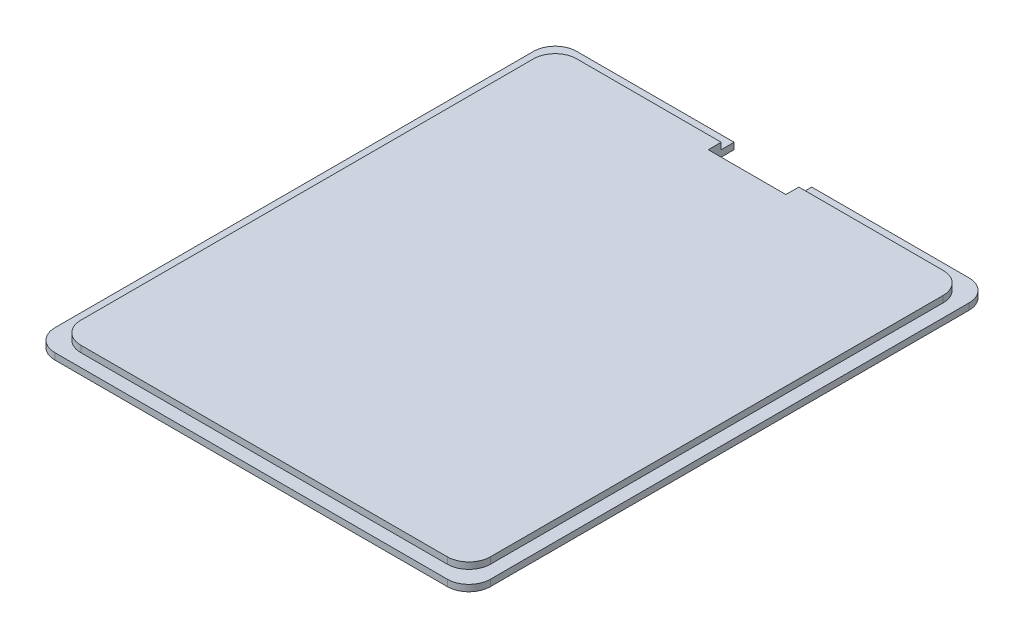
from build123d import *

# Parameters (mm, degrees)
ESQUISSE1_W             = 101
ESQUISSE1_H             = 121
BOSS_EXTRU_1_DEPTH      = 1.5
ESQUISSE4_W             = 95
ESQUISSE4_H             = 115
BOSS_EXTRU_3_DEPTH      = 1.5
CONG_2_R                = 5
ENL_V_MAT_EXTRU_2_DEPTH = 1
ENL_V_MAT_EXTRU_3_DEPTH = 1
ESQUISSE11_W            = 18
ESQUISSE11_H            = 8.115720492
ENL_V_MAT_EXTRU_4_DEPTH = 6


with BuildPart() as part:
    # Esquisse1 → Boss.-Extru.1 (new body)
    with BuildSketch(Plane(origin=(0, 0, 0), x_dir=(1, 0, 0), z_dir=(0, 1, 0))):
        Rectangle(ESQUISSE1_W, ESQUISSE1_H)
    extrude(amount=BOSS_EXTRU_1_DEPTH)

    # Esquisse4 → Boss.-Extru.3 (add)
    with BuildSketch(Plane(origin=(0, 1.5, 0), x_dir=(1, 0, 0), z_dir=(0, 1, 0))):
        Rectangle(ESQUISSE4_W, ESQUISSE4_H)
    extrude(amount=BOSS_EXTRU_3_DEPTH)

    # Cong_2
    cong_2_edges = [part.edges().sort_by_distance(p)[0] for p in [
        (47.5, 2.25, -57.5),
        (-47.5, 2.25, -57.5),
        (-47.5, 2.25, 57.5),
        (47.5, 2.25, 57.5),
        (-50.5, 0.75, -60.5),
        (50.5, 0.75, -60.5),
        (50.5, 0.75, 60.5),
        (-50.5, 0.75, 60.5),
    ]]
    fillet(cong_2_edges, radius=CONG_2_R)

    # Esquisse9 → Enl_v. mat.-Extru.2 (cut)
    # profile 1 of 4: a face of its own
    with BuildSketch(Plane.XZ):
        with BuildLine():
            Line((17.756410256, 6.536159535), (20.064102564, 6.536159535))
            add(Edge.make_bspline(
                [(20.064102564, 6.536159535), (20.05319979, 6.400313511), (20.031855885, 6.134373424), (19.958926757, 5.747839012), (19.853264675, 5.383051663), (19.711927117, 5.041039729), (19.539979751, 4.720111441), (19.330761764, 4.423514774), (19.090259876, 4.148273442), (18.816957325, 3.898725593), (18.518816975, 3.67403333), (18.196952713, 3.479581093), (17.854912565, 3.314454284), (17.492265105, 3.18095124), (17.110224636, 3.072979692), (16.706152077, 3.001609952), (16.282578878, 2.952826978), (15.993067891, 2.948581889), (15.845352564, 2.946415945)],
                knots=[0, 0, 0, 0, 1.056841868, 2.068935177, 3.046078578, 3.998599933, 4.935163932, 5.86512691, 6.808715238, 7.765748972, 8.731494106, 9.700901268, 10.678786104, 11.673881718, 12.695859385, 13.754743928, 14.85441745, 16, 16, 16, 16], degree=3))
            add(Edge.make_bspline(
                [(15.845352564, 2.946415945), (15.753840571, 2.947538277), (15.572640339, 2.949760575), (15.305273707, 2.968366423), (15.045586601, 2.997285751), (14.794673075, 3.042942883), (14.550917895, 3.095749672), (14.31507311, 3.161622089), (14.089160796, 3.242896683), (13.799799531, 3.360730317), (13.462694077, 3.540404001), (13.09617259, 3.801483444), (12.770077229, 4.103416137), (12.53854975, 4.391142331), (12.379366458, 4.635598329), (12.2747231, 4.820139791), (12.185625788, 5.00526088), (12.11366012, 5.191573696), (12.056741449, 5.378958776), (12.017018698, 5.567295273), (11.991830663, 5.756230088), (11.988726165, 5.882370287), (11.987179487, 5.945214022)],
                knots=[0, 0, 0, 0, 1.013132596, 2.00607435, 2.966243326, 3.904617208, 4.828431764, 5.727203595, 6.61345083, 7.485302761, 9.185340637, 10.828629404, 12.45552056, 14.090522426, 14.902580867, 15.683901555, 16.43787889, 17.175178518, 17.893248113, 18.603780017, 19.304395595, 20, 20, 20, 20], degree=3))
            add(Edge.make_bspline(
                [(11.987179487, 5.945214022), (11.989293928, 6.021415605), (11.99355504, 6.17498036), (12.022773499, 6.407476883), (12.070974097, 6.643848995), (12.139516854, 6.884836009), (12.228639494, 7.129176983), (12.335142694, 7.378871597), (12.461652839, 7.631886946), (12.606525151, 7.892451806), (12.782082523, 8.157822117), (12.983254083, 8.437386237), (13.222597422, 8.724238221), (13.487716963, 9.028082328), (13.789877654, 9.339515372), (14.122640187, 9.663300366), (14.485424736, 10.0013597), (14.742878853, 10.224855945), (14.875801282, 10.340246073)],
                knots=[0, 0, 0, 0, 0.67522145, 1.360735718, 2.073273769, 2.811302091, 3.578729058, 4.376688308, 5.215569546, 6.084587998, 7.016822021, 8.033531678, 9.135168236, 10.32585616, 11.606457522, 12.978966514, 14.440253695, 16, 16, 16, 16], degree=3))
            Line((14.875801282, 10.340246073), (16.25, 11.536159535))
            Line((16.25, 11.536159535), (11.858974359, 11.536159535))
            Line((11.858974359, 11.536159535), (11.858974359, 13.202826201))
            Line((11.858974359, 13.202826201), (20.448717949, 13.202826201))
            Line((20.448717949, 13.202826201), (20.448717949, 12.293371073))
            Line((20.448717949, 12.293371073), (16.608573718, 9.142329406))
            add(Edge.make_bspline(
                [(16.608573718, 9.142329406), (16.496651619, 9.050671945), (16.281062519, 8.87411745), (15.97659953, 8.611514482), (15.700713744, 8.363086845), (15.455585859, 8.126578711), (15.235145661, 7.907319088), (15.047750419, 7.699109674), (14.887039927, 7.506448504), (14.755861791, 7.324204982), (14.64549885, 7.151595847), (14.553743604, 6.984069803), (14.472814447, 6.823214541), (14.407846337, 6.66517991), (14.357846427, 6.511108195), (14.320915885, 6.361298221), (14.300645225, 6.214859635), (14.296782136, 6.118879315), (14.294871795, 6.071415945)],
                knots=[0, 0, 0, 0, 1.755009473, 3.380573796, 4.877511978, 6.258327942, 7.512837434, 8.648485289, 9.65565559, 10.555016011, 11.370810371, 12.139555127, 12.871388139, 13.554377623, 14.210211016, 14.835041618, 15.423914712, 16, 16, 16, 16], degree=3))
            add(Edge.make_bspline(
                [(14.294871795, 6.071415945), (14.296530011, 6.024584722), (14.299817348, 5.931743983), (14.322328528, 5.796062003), (14.357818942, 5.665751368), (14.4115499, 5.543899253), (14.474903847, 5.425088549), (14.558056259, 5.316437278), (14.653818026, 5.21235185), (14.800317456, 5.081819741), (15.014361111, 4.943857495), (15.304863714, 4.825077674), (15.629632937, 4.753929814), (15.856999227, 4.745620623), (15.975560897, 4.74128774)],
                knots=[0, 0, 0, 0, 0.704141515, 1.395928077, 2.063603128, 2.729538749, 3.394792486, 4.083730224, 4.780238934, 5.520004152, 7.029765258, 8.583315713, 10.218347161, 12, 12, 12, 12], degree=3))
            add(Edge.make_bspline(
                [(15.975560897, 4.74128774), (16.037054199, 4.742926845), (16.157106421, 4.746126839), (16.333625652, 4.768309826), (16.501743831, 4.806705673), (16.663215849, 4.858364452), (16.81637983, 4.92689774), (16.960827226, 5.011705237), (17.097643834, 5.110311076), (17.226090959, 5.222640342), (17.343637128, 5.347517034), (17.446911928, 5.485367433), (17.534876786, 5.634098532), (17.609579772, 5.793652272), (17.669862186, 5.963951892), (17.713089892, 6.145380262), (17.743964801, 6.33691774), (17.752190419, 6.468603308), (17.756410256, 6.536159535)],
                knots=[0, 0, 0, 0, 1.044651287, 2.039453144, 3.016437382, 3.970698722, 4.915200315, 5.860791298, 6.811607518, 7.776330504, 8.755485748, 9.719741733, 10.696396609, 11.686010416, 12.70856171, 13.759599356, 14.850648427, 16, 16, 16, 16], degree=3))
        make_face()
    # profile 2 of 4: a face of its own
    with BuildSketch(Plane.XZ):
        with BuildLine():
            Line((7.884615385, 6.536159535), (10.192307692, 6.536159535))
            add(Edge.make_bspline(
                [(10.192307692, 6.536159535), (10.181404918, 6.400313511), (10.160061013, 6.134373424), (10.087131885, 5.747839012), (9.981469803, 5.383051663), (9.840132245, 5.041039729), (9.66818488, 4.720111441), (9.458966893, 4.423514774), (9.218465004, 4.148273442), (8.945162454, 3.898725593), (8.647022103, 3.67403333), (8.325157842, 3.479581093), (7.983117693, 3.314454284), (7.620470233, 3.18095124), (7.238429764, 3.072979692), (6.834357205, 3.001609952), (6.410784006, 2.952826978), (6.121273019, 2.948581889), (5.973557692, 2.946415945)],
                knots=[0, 0, 0, 0, 1.056841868, 2.068935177, 3.046078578, 3.998599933, 4.935163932, 5.86512691, 6.808715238, 7.765748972, 8.731494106, 9.700901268, 10.678786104, 11.673881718, 12.695859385, 13.754743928, 14.85441745, 16, 16, 16, 16], degree=3))
            add(Edge.make_bspline(
                [(5.973557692, 2.946415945), (5.8820457, 2.947538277), (5.700845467, 2.949760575), (5.433478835, 2.968366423), (5.173791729, 2.997285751), (4.922878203, 3.042942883), (4.679123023, 3.095749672), (4.443278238, 3.161622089), (4.217365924, 3.242896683), (3.928004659, 3.360730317), (3.590899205, 3.540404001), (3.224377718, 3.801483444), (2.898282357, 4.103416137), (2.666754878, 4.391142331), (2.507571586, 4.635598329), (2.402928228, 4.820139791), (2.313830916, 5.00526088), (2.241865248, 5.191573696), (2.184946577, 5.378958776), (2.145223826, 5.567295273), (2.120035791, 5.756230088), (2.116931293, 5.882370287), (2.115384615, 5.945214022)],
                knots=[0, 0, 0, 0, 1.013132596, 2.00607435, 2.966243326, 3.904617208, 4.828431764, 5.727203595, 6.61345083, 7.485302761, 9.185340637, 10.828629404, 12.45552056, 14.090522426, 14.902580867, 15.683901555, 16.43787889, 17.175178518, 17.893248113, 18.603780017, 19.304395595, 20, 20, 20, 20], degree=3))
            add(Edge.make_bspline(
                [(2.115384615, 5.945214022), (2.117499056, 6.021415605), (2.121760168, 6.17498036), (2.150978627, 6.407476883), (2.199179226, 6.643848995), (2.267721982, 6.884836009), (2.356844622, 7.129176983), (2.463347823, 7.378871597), (2.589857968, 7.631886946), (2.734730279, 7.892451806), (2.910287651, 8.157822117), (3.111459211, 8.437386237), (3.350802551, 8.724238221), (3.615922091, 9.028082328), (3.918082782, 9.339515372), (4.250845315, 9.663300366), (4.613629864, 10.0013597), (4.871083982, 10.224855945), (5.00400641, 10.340246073)],
                knots=[0, 0, 0, 0, 0.67522145, 1.360735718, 2.073273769, 2.811302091, 3.578729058, 4.376688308, 5.215569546, 6.084587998, 7.016822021, 8.033531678, 9.135168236, 10.32585616, 11.606457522, 12.978966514, 14.440253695, 16, 16, 16, 16], degree=3))
            Line((5.00400641, 10.340246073), (6.378205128, 11.536159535))
            Line((6.378205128, 11.536159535), (1.987179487, 11.536159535))
            Line((1.987179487, 11.536159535), (1.987179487, 13.202826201))
            Line((1.987179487, 13.202826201), (10.576923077, 13.202826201))
            Line((10.576923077, 13.202826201), (10.576923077, 12.293371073))
            Line((10.576923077, 12.293371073), (6.736778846, 9.142329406))
            add(Edge.make_bspline(
                [(6.736778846, 9.142329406), (6.624856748, 9.050671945), (6.409267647, 8.87411745), (6.104804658, 8.611514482), (5.828918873, 8.363086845), (5.583790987, 8.126578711), (5.363350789, 7.907319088), (5.175955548, 7.699109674), (5.015245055, 7.506448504), (4.884066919, 7.324204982), (4.773703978, 7.151595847), (4.681948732, 6.984069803), (4.601019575, 6.823214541), (4.536051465, 6.66517991), (4.486051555, 6.511108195), (4.449121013, 6.361298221), (4.428850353, 6.214859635), (4.424987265, 6.118879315), (4.423076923, 6.071415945)],
                knots=[0, 0, 0, 0, 1.755009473, 3.380573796, 4.877511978, 6.258327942, 7.512837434, 8.648485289, 9.65565559, 10.555016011, 11.370810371, 12.139555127, 12.871388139, 13.554377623, 14.210211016, 14.835041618, 15.423914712, 16, 16, 16, 16], degree=3))
            add(Edge.make_bspline(
                [(4.423076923, 6.071415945), (4.424735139, 6.024584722), (4.428022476, 5.931743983), (4.450533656, 5.796062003), (4.486024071, 5.665751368), (4.539755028, 5.543899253), (4.603108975, 5.425088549), (4.686261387, 5.316437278), (4.782023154, 5.21235185), (4.928522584, 5.081819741), (5.142566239, 4.943857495), (5.433068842, 4.825077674), (5.757838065, 4.753929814), (5.985204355, 4.745620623), (6.103766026, 4.74128774)],
                knots=[0, 0, 0, 0, 0.704141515, 1.395928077, 2.063603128, 2.729538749, 3.394792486, 4.083730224, 4.780238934, 5.520004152, 7.029765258, 8.583315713, 10.218347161, 12, 12, 12, 12], degree=3))
            add(Edge.make_bspline(
                [(6.103766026, 4.74128774), (6.165259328, 4.742926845), (6.285311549, 4.746126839), (6.46183078, 4.768309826), (6.629948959, 4.806705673), (6.791420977, 4.858364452), (6.944584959, 4.92689774), (7.089032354, 5.011705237), (7.225848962, 5.110311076), (7.354296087, 5.222640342), (7.471842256, 5.347517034), (7.575117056, 5.485367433), (7.663081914, 5.634098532), (7.7377849, 5.793652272), (7.798067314, 5.963951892), (7.841295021, 6.145380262), (7.872169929, 6.33691774), (7.880395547, 6.468603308), (7.884615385, 6.536159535)],
                knots=[0, 0, 0, 0, 1.044651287, 2.039453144, 3.016437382, 3.970698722, 4.915200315, 5.860791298, 6.811607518, 7.776330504, 8.755485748, 9.719741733, 10.696396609, 11.686010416, 12.70856171, 13.759599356, 14.850648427, 16, 16, 16, 16], degree=3))
        make_face()
    # profile 3 of 4: a face of its own
    with BuildSketch(Plane.XZ):
        with BuildLine():
            add(Edge.make_bspline(
                [(-3.808092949, 2.946415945), (-3.920995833, 2.947717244), (-4.143108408, 2.950277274), (-4.470057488, 2.977533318), (-4.785052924, 3.019133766), (-5.088993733, 3.076899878), (-5.38070832, 3.152753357), (-5.660793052, 3.245800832), (-5.929433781, 3.352724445), (-6.185069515, 3.47981438), (-6.427190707, 3.624174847), (-6.657587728, 3.784516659), (-6.871271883, 3.965084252), (-7.070937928, 4.163217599), (-7.257615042, 4.377730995), (-7.429869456, 4.610069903), (-7.586740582, 4.861142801), (-7.731956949, 5.129887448), (-7.860889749, 5.422210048), (-7.971022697, 5.740490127), (-8.061887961, 6.085701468), (-8.13776756, 6.45757087), (-8.197966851, 6.856681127), (-8.238323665, 7.283360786), (-8.265568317, 7.736392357), (-8.267988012, 8.047201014), (-8.269230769, 8.206832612)],
                knots=[0, 0, 0, 0, 1.028268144, 2.022900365, 2.98639299, 3.92166981, 4.839334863, 5.729929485, 6.608709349, 7.471041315, 8.327496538, 9.174634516, 10.025107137, 10.872441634, 11.7347736, 12.61313233, 13.504204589, 14.429498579, 15.393586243, 16.411220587, 17.494218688, 18.643016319, 19.867155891, 21.169057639, 22.546025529, 24, 24, 24, 24], degree=3))
            add(Edge.make_bspline(
                [(-8.269230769, 8.206832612), (-8.267920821, 8.368459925), (-8.265374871, 8.682590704), (-8.239188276, 9.139796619), (-8.195201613, 9.569529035), (-8.13576735, 9.971393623), (-8.061011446, 10.346644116), (-7.964435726, 10.692937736), (-7.853059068, 11.012626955), (-7.724054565, 11.305877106), (-7.57818316, 11.574887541), (-7.42289675, 11.826038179), (-7.253034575, 12.057497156), (-7.073730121, 12.271660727), (-6.882204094, 12.468011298), (-6.678148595, 12.643847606), (-6.461513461, 12.801560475), (-6.233286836, 12.941920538), (-5.990628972, 13.064751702), (-5.733833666, 13.17173072), (-5.460308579, 13.257965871), (-5.173363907, 13.333963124), (-4.870257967, 13.387763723), (-4.553011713, 13.431240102), (-4.219773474, 13.454672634), (-3.992420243, 13.457692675), (-3.876201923, 13.459236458)],
                knots=[0, 0, 0, 0, 1.481528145, 2.879424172, 4.1962608, 5.440246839, 6.602304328, 7.701273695, 8.733142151, 9.703325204, 10.634469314, 11.536362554, 12.408088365, 13.263938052, 14.09502223, 14.91963415, 15.730153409, 16.549020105, 17.373018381, 18.221039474, 19.096004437, 20.000159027, 20.940213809, 21.915865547, 22.934633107, 24, 24, 24, 24], degree=3))
            add(Edge.make_bspline(
                [(-3.876201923, 13.459236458), (-3.759981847, 13.457692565), (-3.531959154, 13.454663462), (-3.19676056, 13.431036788), (-2.876746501, 13.388103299), (-2.5699111, 13.333191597), (-2.278291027, 13.258905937), (-1.99947912, 13.168899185), (-1.736310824, 13.06041834), (-1.485494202, 12.938638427), (-1.250631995, 12.797060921), (-1.027674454, 12.640494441), (-0.816308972, 12.468266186), (-0.619438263, 12.277128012), (-0.437277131, 12.068227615), (-0.268029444, 11.842466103), (-0.112582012, 11.599500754), (0.033796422, 11.340155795), (0.163073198, 11.056322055), (0.274475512, 10.74603687), (0.367944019, 10.406980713), (0.446750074, 10.040688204), (0.502095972, 9.644764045), (0.547156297, 9.221984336), (0.572999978, 8.770723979), (0.575589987, 8.4606037), (0.576923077, 8.300983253)],
                knots=[0, 0, 0, 0, 1.069936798, 2.099205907, 3.091231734, 4.041363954, 4.967262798, 5.859573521, 6.736311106, 7.585837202, 8.423988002, 9.257980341, 10.092335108, 10.931387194, 11.78091329, 12.641554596, 13.526550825, 14.434729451, 15.381035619, 16.39416994, 17.466593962, 18.616838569, 19.840935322, 21.145076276, 22.530556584, 24, 24, 24, 24], degree=3))
            add(Edge.make_bspline(
                [(0.576923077, 8.300983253), (0.574214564, 8.079198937), (0.568985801, 7.651046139), (0.518735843, 7.032065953), (0.435302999, 6.460593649), (0.322027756, 5.934880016), (0.16829056, 5.458333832), (-0.011902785, 5.026092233), (-0.229493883, 4.640619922), (-0.406464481, 4.416106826), (-0.492788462, 4.306592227)],
                knots=[0, 0, 0, 0, 1.261745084, 2.435788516, 3.530293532, 4.546109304, 5.491716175, 6.375230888, 7.207458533, 8, 8, 8, 8], degree=3))
            add(Edge.make_bspline(
                [(-0.492788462, 4.306592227), (-0.594414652, 4.197749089), (-0.796293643, 3.981533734), (-1.142992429, 3.70566202), (-1.514869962, 3.468632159), (-1.918040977, 3.278258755), (-2.34861777, 3.126675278), (-2.809655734, 3.021730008), (-3.299560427, 2.959243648), (-3.635629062, 2.950766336), (-3.808092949, 2.946415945)],
                knots=[0, 0, 0, 0, 0.964848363, 1.916657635, 2.864803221, 3.81996753, 4.802199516, 5.82034527, 6.88144359, 8, 8, 8, 8], degree=3))
        make_face()
        with BuildLine():
            add(Edge.make_bspline(
                [(-3.864182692, 4.74128774), (-3.761054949, 4.745036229), (-3.559766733, 4.752352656), (-3.267113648, 4.812673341), (-2.992465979, 4.90894666), (-2.777966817, 5.021281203), (-2.617844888, 5.132146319), (-2.505157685, 5.231107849), (-2.400755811, 5.34461053), (-2.302327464, 5.470847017), (-2.212021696, 5.61176607), (-2.130931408, 5.76671881), (-2.053462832, 5.933825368), (-1.985620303, 6.117416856), (-1.925375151, 6.318789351), (-1.873988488, 6.541110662), (-1.827495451, 6.784127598), (-1.79252597, 7.049747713), (-1.764570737, 7.336374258), (-1.745019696, 7.645044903), (-1.732874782, 7.975697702), (-1.731485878, 8.203482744), (-1.730769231, 8.321015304)],
                knots=[0, 0, 0, 0, 1.304668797, 2.546496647, 3.765760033, 4.979677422, 5.598847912, 6.227923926, 6.873983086, 7.548721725, 8.2522406, 8.989734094, 9.761466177, 10.582730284, 11.465361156, 12.420932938, 13.470498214, 14.596763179, 15.811475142, 17.116143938, 18.511987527, 20, 20, 20, 20], degree=3))
            add(Edge.make_bspline(
                [(-1.730769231, 8.321015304), (-1.732675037, 8.473304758), (-1.736331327, 8.765472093), (-1.764373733, 9.18537688), (-1.809651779, 9.568672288), (-1.871846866, 9.915992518), (-1.955792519, 10.226363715), (-2.057447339, 10.500415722), (-2.175716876, 10.740074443), (-2.319466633, 10.94073391), (-2.474903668, 11.111893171), (-2.640431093, 11.260215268), (-2.817614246, 11.384515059), (-3.004944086, 11.488564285), (-3.204794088, 11.56615863), (-3.414958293, 11.622605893), (-3.636010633, 11.657290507), (-3.787268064, 11.661980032), (-3.864182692, 11.664364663)],
                knots=[0, 0, 0, 0, 1.626713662, 3.120850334, 4.493094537, 5.748035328, 6.886636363, 7.922689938, 8.86694318, 9.731802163, 10.549891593, 11.332995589, 12.100845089, 12.857413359, 13.616398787, 14.384645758, 15.178589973, 16, 16, 16, 16], degree=3))
            add(Edge.make_bspline(
                [(-3.864182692, 11.664364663), (-3.938432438, 11.662737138), (-4.08299668, 11.659568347), (-4.293933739, 11.626206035), (-4.49327613, 11.572915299), (-4.680747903, 11.495141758), (-4.858359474, 11.400062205), (-5.021855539, 11.279126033), (-5.175111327, 11.139323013), (-5.264943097, 11.031793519), (-5.310496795, 10.977265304)],
                knots=[0, 0, 0, 0, 1.071620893, 2.0864457, 3.076119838, 4.045040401, 5.011798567, 5.978268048, 6.974779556, 8, 8, 8, 8], degree=3))
            add(Edge.make_bspline(
                [(-5.310496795, 10.977265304), (-5.363231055, 10.903717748), (-5.47242114, 10.751432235), (-5.603010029, 10.48879394), (-5.714406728, 10.19329152), (-5.806773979, 9.862900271), (-5.87426198, 9.497273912), (-5.926983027, 9.098222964), (-5.956147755, 8.663998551), (-5.959695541, 8.363123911), (-5.961538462, 8.206832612)],
                knots=[0, 0, 0, 0, 0.74961532, 1.552132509, 2.423335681, 3.366667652, 4.393105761, 5.504592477, 6.703744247, 8, 8, 8, 8], degree=3))
            add(Edge.make_bspline(
                [(-5.961538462, 8.206832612), (-5.959351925, 8.049219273), (-5.955142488, 7.745788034), (-5.930657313, 7.309708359), (-5.884767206, 6.911785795), (-5.821874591, 6.552157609), (-5.74046493, 6.230388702), (-5.641926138, 5.945388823), (-5.521571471, 5.699543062), (-5.384613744, 5.488939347), (-5.228610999, 5.314180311), (-5.066976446, 5.160245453), (-4.89263261, 5.030715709), (-4.708028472, 4.923899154), (-4.512191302, 4.841159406), (-4.30569504, 4.7826784), (-4.088349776, 4.748460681), (-3.93975756, 4.743705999), (-3.864182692, 4.74128774)],
                knots=[0, 0, 0, 0, 1.653923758, 3.184071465, 4.58070258, 5.854763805, 7.012037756, 8.060241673, 9.012827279, 9.877593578, 10.686997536, 11.465232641, 12.216343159, 12.960262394, 13.698118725, 14.441113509, 15.207141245, 16, 16, 16, 16], degree=3))
        make_face(mode=Mode.SUBTRACT)
    # profile 4 of 4: a face of its own
    with BuildSketch(Plane.XZ):
        Polygon((-9.230769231, 3.202826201), (-11.704727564, 3.202826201), (-15, 10.306191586), (-18.303285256, 3.202826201), (-20.769230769, 3.202826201), (-16.119791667, 13.202826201), (-13.872195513, 13.202826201), align=None)
    extrude(amount=-ENL_V_MAT_EXTRU_2_DEPTH, mode=Mode.SUBTRACT)

    # Esquisse10 → Enl_v. mat.-Extru.3 (cut)
    # profile 1 of 10: a face of its own
    with BuildSketch(Plane.XZ):
        with BuildLine():
            Line((41.230769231, 27.503817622), (39.421474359, 27.503817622))
            add(Edge.make_bspline(
                [(39.421474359, 27.503817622), (39.280415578, 27.504780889), (39.007747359, 27.506642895), (38.612760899, 27.528425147), (38.245199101, 27.560411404), (37.905893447, 27.609364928), (37.593622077, 27.666183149), (37.310690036, 27.742274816), (37.054794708, 27.829596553), (36.823250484, 27.931338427), (36.612450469, 28.050658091), (36.413708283, 28.184708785), (36.224729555, 28.335501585), (36.044467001, 28.503387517), (35.872481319, 28.687250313), (35.712809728, 28.890792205), (35.560333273, 29.108741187), (35.417525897, 29.341853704), (35.290409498, 29.589669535), (35.17726165, 29.848288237), (35.082989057, 30.117877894), (35.006228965, 30.398066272), (34.945085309, 30.688041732), (34.902293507, 30.988356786), (34.875841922, 31.298742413), (34.87315843, 31.50910565), (34.871794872, 31.615997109)],
                knots=[0, 0, 0, 0, 1.44349102, 2.790284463, 4.047513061, 5.218094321, 6.297837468, 7.293772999, 8.213586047, 9.062895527, 9.878013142, 10.689252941, 11.514048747, 12.349645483, 13.208421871, 14.087867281, 14.994836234, 15.929653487, 16.883274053, 17.843080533, 18.816554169, 19.803369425, 20.81449504, 21.847452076, 22.906230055, 24, 24, 24, 24], degree=3))
            add(Edge.make_bspline(
                [(34.871794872, 31.615997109), (34.875365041, 31.766828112), (34.882393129, 32.063747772), (34.941600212, 32.499471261), (35.037342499, 32.91716601), (35.172019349, 33.313516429), (35.338793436, 33.685166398), (35.538525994, 34.024671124), (35.765479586, 34.332722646), (36.021668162, 34.604209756), (36.298619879, 34.83898529), (36.587555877, 35.03771112), (36.888217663, 35.197224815), (37.153700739, 35.296836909), (37.384556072, 35.359443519), (37.586944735, 35.395813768), (37.817280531, 35.429545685), (38.076431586, 35.458539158), (38.365166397, 35.478393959), (38.682590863, 35.4921051), (39.028781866, 35.502293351), (39.269222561, 35.503296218), (39.394230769, 35.503817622)],
                knots=[0, 0, 0, 0, 1.315347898, 2.589339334, 3.828278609, 5.048487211, 6.235212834, 7.375728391, 8.47833097, 9.56625089, 10.624194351, 11.640157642, 12.619895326, 13.585848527, 14.106971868, 14.704705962, 15.37825295, 16.137840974, 16.978850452, 17.902510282, 18.909488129, 20, 20, 20, 20], degree=3))
            Line((39.394230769, 35.503817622), (41.230769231, 35.503817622))
            Line((41.230769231, 35.503817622), (41.230769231, 27.503817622))
        make_face()
        with BuildLine():
            Line((39.794871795, 28.939715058), (39.794871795, 34.067920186))
            Line((39.794871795, 34.067920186), (39.044871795, 34.067920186))
            add(Edge.make_bspline(
                [(39.044871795, 34.067920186), (38.955648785, 34.067488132), (38.78406922, 34.066657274), (38.536044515, 34.055241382), (38.307151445, 34.03670333), (38.097090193, 34.009282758), (37.905377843, 33.976288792), (37.732713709, 33.935479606), (37.578757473, 33.885852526), (37.442239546, 33.827366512), (37.317601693, 33.760591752), (37.202134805, 33.68261942), (37.09069517, 33.595967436), (36.985342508, 33.498165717), (36.885684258, 33.390488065), (36.792309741, 33.272385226), (36.703967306, 33.14421731), (36.622947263, 33.005301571), (36.548840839, 32.857126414), (36.483369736, 32.701043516), (36.428100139, 32.536201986), (36.386128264, 32.362674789), (36.350373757, 32.181538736), (36.324556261, 31.991629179), (36.3104908, 31.793566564), (36.308634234, 31.658753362), (36.307692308, 31.590356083)],
                knots=[0, 0, 0, 0, 1.502729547, 2.8898115, 4.181010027, 5.369596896, 6.45687185, 7.456390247, 8.355533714, 9.177830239, 9.954819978, 10.733423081, 11.521791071, 12.330436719, 13.151797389, 13.990712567, 14.864234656, 15.771624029, 16.697123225, 17.652960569, 18.620374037, 19.622036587, 20.657870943, 21.729319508, 22.8479736, 24, 24, 24, 24], degree=3))
            add(Edge.make_bspline(
                [(36.307692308, 31.590356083), (36.309598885, 31.485547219), (36.313316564, 31.281178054), (36.349393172, 30.983549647), (36.407523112, 30.703638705), (36.492202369, 30.442164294), (36.596335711, 30.197464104), (36.728743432, 29.972691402), (36.881381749, 29.764161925), (37.002153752, 29.641854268), (37.0625, 29.580740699)],
                knots=[0, 0, 0, 0, 1.138242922, 2.219485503, 3.251901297, 4.239342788, 5.201071, 6.134757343, 7.067992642, 8, 8, 8, 8], degree=3))
            add(Edge.make_bspline(
                [(37.0625, 29.580740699), (37.122002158, 29.528661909), (37.243528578, 29.422296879), (37.456889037, 29.294844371), (37.692001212, 29.182864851), (37.954243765, 29.09407758), (38.241082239, 29.02386082), (38.554225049, 28.975434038), (38.891995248, 28.944315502), (39.125994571, 28.941281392), (39.246794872, 28.939715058)],
                knots=[0, 0, 0, 0, 0.813307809, 1.661089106, 2.549956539, 3.493439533, 4.508053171, 5.589449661, 6.755572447, 8, 8, 8, 8], degree=3))
            Line((39.246794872, 28.939715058), (39.794871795, 28.939715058))
        make_face(mode=Mode.SUBTRACT)
    # profile 2 of 10: a face of its own
    with BuildSketch(Plane.XZ):
        with BuildLine():
            add(Edge.make_bspline(
                [(29.676282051, 27.298689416), (29.537191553, 27.302289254), (29.262595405, 27.309396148), (28.858775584, 27.368682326), (28.46957385, 27.465169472), (28.094934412, 27.59984999), (27.736134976, 27.774273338), (27.39185722, 27.986057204), (27.063044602, 28.236998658), (26.753530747, 28.523516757), (26.469714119, 28.836815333), (26.220236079, 29.17083675), (26.008460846, 29.522132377), (25.836562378, 29.89077066), (25.702322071, 30.276245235), (25.609026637, 30.678702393), (25.548871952, 31.097626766), (25.541969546, 31.382881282), (25.538461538, 31.527856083)],
                knots=[0, 0, 0, 0, 1.014151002, 2.002163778, 2.969868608, 3.93493411, 4.9003771, 5.874719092, 6.87846472, 7.912488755, 8.947011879, 9.957751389, 10.948740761, 11.933621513, 12.919426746, 13.920294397, 14.943031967, 16, 16, 16, 16], degree=3))
            add(Edge.make_bspline(
                [(25.538461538, 31.527856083), (25.542198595, 31.671197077), (25.549562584, 31.953655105), (25.606563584, 32.368722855), (25.701480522, 32.766854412), (25.833132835, 33.148185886), (26.002025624, 33.512723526), (26.21056664, 33.859284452), (26.457385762, 34.18858074), (26.737441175, 34.498594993), (27.043855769, 34.781826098), (27.370334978, 35.030468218), (27.713845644, 35.239599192), (28.072193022, 35.413182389), (28.448757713, 35.543625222), (28.839364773, 35.64126207), (29.247281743, 35.697721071), (29.524402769, 35.705166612), (29.665064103, 35.708945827)],
                knots=[0, 0, 0, 0, 1.051517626, 2.07204922, 3.067438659, 4.05042616, 5.027204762, 6.009981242, 7.012629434, 8.042243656, 9.071350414, 10.070091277, 11.048190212, 12.017682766, 12.985867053, 13.966945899, 14.968060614, 16, 16, 16, 16], degree=3))
            add(Edge.make_bspline(
                [(29.665064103, 35.708945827), (29.812190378, 35.705595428), (30.101273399, 35.699012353), (30.524452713, 35.636938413), (30.929317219, 35.542298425), (31.314757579, 35.405282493), (31.680474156, 35.227249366), (32.028107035, 35.012287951), (32.355041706, 34.756245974), (32.660188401, 34.466846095), (32.936619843, 34.15009703), (33.180633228, 33.815501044), (33.386461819, 33.465588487), (33.554116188, 33.100202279), (33.686288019, 32.721611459), (33.779520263, 32.327510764), (33.834594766, 31.918845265), (33.842266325, 31.641271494), (33.846153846, 31.500612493)],
                knots=[0, 0, 0, 0, 1.067953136, 2.098381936, 3.099641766, 4.083805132, 5.062469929, 6.048665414, 7.046702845, 8.073106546, 9.098695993, 10.09591865, 11.076726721, 12.041940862, 13.011263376, 13.984305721, 14.978557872, 16, 16, 16, 16], degree=3))
            add(Edge.make_bspline(
                [(33.846153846, 31.500612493), (33.844916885, 31.405988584), (33.842458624, 31.21793892), (33.813496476, 30.939186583), (33.770542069, 30.666274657), (33.711738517, 30.398689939), (33.63251058, 30.137122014), (33.536215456, 29.880911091), (33.424001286, 29.630058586), (33.294598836, 29.386833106), (33.148218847, 29.154144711), (32.991924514, 28.929961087), (32.819729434, 28.720167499), (32.635187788, 28.522485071), (32.437576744, 28.337817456), (32.226552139, 28.165534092), (32.002446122, 28.0060744), (31.7676827, 27.85812069), (31.523064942, 27.728536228), (31.274412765, 27.611077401), (31.019339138, 27.515841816), (30.759696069, 27.436964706), (30.496080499, 27.373662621), (30.226457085, 27.331572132), (29.953101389, 27.302381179), (29.768774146, 27.299922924), (29.676282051, 27.298689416)],
                knots=[0, 0, 0, 0, 1.034641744, 2.056182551, 3.061960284, 4.05571729, 5.050247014, 6.048716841, 7.047801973, 8.054190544, 9.059424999, 10.053182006, 11.041513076, 12.025412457, 13.009311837, 13.997642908, 15.002928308, 16.016213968, 17.030509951, 18.02913364, 19.022134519, 20.005478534, 20.996155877, 21.984625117, 22.988721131, 24, 24, 24, 24], degree=3))
        make_face()
        with BuildLine():
            add(Edge.make_bspline(
                [(29.698717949, 28.734586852), (29.792325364, 28.737098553), (29.977068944, 28.742055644), (30.248054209, 28.779821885), (30.508209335, 28.840139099), (30.756093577, 28.927507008), (30.992776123, 29.038707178), (31.218695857, 29.173337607), (31.430651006, 29.336077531), (31.63175035, 29.517995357), (31.812797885, 29.721530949), (31.975584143, 29.937277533), (32.10720344, 30.170426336), (32.220377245, 30.413298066), (32.303973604, 30.672034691), (32.367623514, 30.942436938), (32.402291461, 31.227280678), (32.407563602, 31.420933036), (32.41025641, 31.519843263)],
                knots=[0, 0, 0, 0, 1.033668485, 2.040047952, 3.016132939, 3.979056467, 4.937231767, 5.900589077, 6.877725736, 7.88429546, 8.891280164, 9.882584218, 10.863295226, 11.842887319, 12.837417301, 13.860812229, 14.907384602, 16, 16, 16, 16], degree=3))
            add(Edge.make_bspline(
                [(32.41025641, 31.519843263), (32.40698317, 31.629488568), (32.400568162, 31.8443752), (32.356088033, 32.158014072), (32.278150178, 32.453874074), (32.171677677, 32.732944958), (32.030145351, 32.992292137), (31.860869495, 33.235059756), (31.65961181, 33.45974157), (31.504836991, 33.591029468), (31.426282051, 33.657663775)],
                knots=[0, 0, 0, 0, 1.078343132, 2.113373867, 3.107373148, 4.082093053, 5.043582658, 6.005574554, 6.987742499, 8, 8, 8, 8], degree=3))
            add(Edge.make_bspline(
                [(31.426282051, 33.657663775), (31.361913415, 33.706882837), (31.234626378, 33.804212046), (31.031448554, 33.928959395), (30.822215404, 34.035880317), (30.605347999, 34.122271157), (30.381304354, 34.190224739), (30.150115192, 34.237811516), (29.912108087, 34.267676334), (29.751156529, 34.271245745), (29.669871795, 34.273048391)],
                knots=[0, 0, 0, 0, 1.023928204, 2.024787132, 3.009472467, 3.9914905, 4.972207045, 5.96565515, 6.972602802, 8, 8, 8, 8], degree=3))
            add(Edge.make_bspline(
                [(29.669871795, 34.273048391), (29.577875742, 34.2705118), (29.396870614, 34.265520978), (29.130904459, 34.228270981), (28.876218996, 34.164954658), (28.630453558, 34.078973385), (28.396899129, 33.963743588), (28.171913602, 33.826917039), (27.958178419, 33.664226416), (27.758299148, 33.477724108), (27.575120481, 33.274178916), (27.413058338, 33.057265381), (27.278844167, 32.826975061), (27.166892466, 32.586384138), (27.079669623, 32.333577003), (27.019978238, 32.06853459), (26.981615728, 31.792326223), (26.976808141, 31.604374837), (26.974358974, 31.508625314)],
                knots=[0, 0, 0, 0, 1.026350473, 2.019376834, 2.989435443, 3.95094063, 4.91865229, 5.889827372, 6.885283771, 7.910196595, 8.935871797, 9.9372888, 10.925850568, 11.904605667, 12.894245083, 13.903507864, 14.931967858, 16, 16, 16, 16], degree=3))
            add(Edge.make_bspline(
                [(26.974358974, 31.508625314), (26.976883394, 31.413422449), (26.981852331, 31.226030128), (27.019311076, 30.950587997), (27.081584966, 30.687001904), (27.169597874, 30.434592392), (27.279243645, 30.19203433), (27.416976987, 29.961432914), (27.579812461, 29.742987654), (27.764773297, 29.537997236), (27.966058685, 29.349611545), (28.18216739, 29.186130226), (28.407042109, 29.044069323), (28.645845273, 28.932784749), (28.893690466, 28.844124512), (29.152090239, 28.778833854), (29.422023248, 28.742320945), (29.605664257, 28.737187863), (29.698717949, 28.734586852)],
                knots=[0, 0, 0, 0, 1.055040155, 2.076685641, 3.074845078, 4.052329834, 5.035358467, 6.020382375, 7.023447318, 8.050688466, 9.077178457, 10.074336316, 11.0503314, 12.019748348, 12.988025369, 13.964577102, 14.968620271, 16, 16, 16, 16], degree=3))
        make_face(mode=Mode.SUBTRACT)
    # profile 3 of 10: a face of its own
    with BuildSketch(Plane.XZ):
        Polygon((21.025641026, 27.503817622), (19.732371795, 27.503817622), (16.102564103, 32.768240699), (16.102564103, 27.503817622), (14.666666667, 27.503817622), (14.666666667, 35.503817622), (15.969551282, 35.503817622), (19.58974359, 30.255420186), (19.58974359, 35.503817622), (21.025641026, 35.503817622), align=None)
    # profile 4 of 10: a face of its own
    with BuildSketch(Plane.XZ):
        with BuildLine():
            add(Edge.make_bspline(
                [(9.060897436, 27.298689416), (8.921806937, 27.302289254), (8.64721079, 27.309396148), (8.243390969, 27.368682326), (7.854189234, 27.465169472), (7.479549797, 27.59984999), (7.120750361, 27.774273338), (6.776472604, 27.986057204), (6.447659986, 28.236998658), (6.138146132, 28.523516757), (5.854329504, 28.836815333), (5.604851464, 29.17083675), (5.393076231, 29.522132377), (5.221177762, 29.89077066), (5.086937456, 30.276245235), (4.993642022, 30.678702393), (4.933487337, 31.097626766), (4.926584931, 31.382881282), (4.923076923, 31.527856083)],
                knots=[0, 0, 0, 0, 1.014151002, 2.002163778, 2.969868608, 3.93493411, 4.9003771, 5.874719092, 6.87846472, 7.912488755, 8.947011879, 9.957751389, 10.948740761, 11.933621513, 12.919426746, 13.920294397, 14.943031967, 16, 16, 16, 16], degree=3))
            add(Edge.make_bspline(
                [(4.923076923, 31.527856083), (4.926813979, 31.671197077), (4.934177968, 31.953655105), (4.991178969, 32.368722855), (5.086095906, 32.766854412), (5.21774822, 33.148185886), (5.386641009, 33.512723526), (5.595182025, 33.859284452), (5.842001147, 34.18858074), (6.122056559, 34.498594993), (6.428471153, 34.781826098), (6.754950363, 35.030468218), (7.098461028, 35.239599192), (7.456808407, 35.413182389), (7.833373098, 35.543625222), (8.223980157, 35.64126207), (8.631897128, 35.697721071), (8.909018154, 35.705166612), (9.049679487, 35.708945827)],
                knots=[0, 0, 0, 0, 1.051517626, 2.07204922, 3.067438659, 4.05042616, 5.027204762, 6.009981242, 7.012629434, 8.042243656, 9.071350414, 10.070091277, 11.048190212, 12.017682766, 12.985867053, 13.966945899, 14.968060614, 16, 16, 16, 16], degree=3))
            add(Edge.make_bspline(
                [(9.049679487, 35.708945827), (9.196805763, 35.705595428), (9.485888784, 35.699012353), (9.909068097, 35.636938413), (10.313932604, 35.542298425), (10.699372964, 35.405282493), (11.065089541, 35.227249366), (11.412722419, 35.012287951), (11.739657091, 34.756245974), (12.044803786, 34.466846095), (12.321235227, 34.15009703), (12.565248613, 33.815501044), (12.771077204, 33.465588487), (12.938731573, 33.100202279), (13.070903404, 32.721611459), (13.164135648, 32.327510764), (13.219210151, 31.918845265), (13.22688171, 31.641271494), (13.230769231, 31.500612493)],
                knots=[0, 0, 0, 0, 1.067953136, 2.098381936, 3.099641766, 4.083805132, 5.062469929, 6.048665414, 7.046702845, 8.073106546, 9.098695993, 10.09591865, 11.076726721, 12.041940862, 13.011263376, 13.984305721, 14.978557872, 16, 16, 16, 16], degree=3))
            add(Edge.make_bspline(
                [(13.230769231, 31.500612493), (13.229532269, 31.405988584), (13.227074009, 31.21793892), (13.19811186, 30.939186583), (13.155157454, 30.666274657), (13.096353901, 30.398689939), (13.017125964, 30.137122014), (12.920830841, 29.880911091), (12.808616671, 29.630058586), (12.679214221, 29.386833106), (12.532834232, 29.154144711), (12.376539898, 28.929961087), (12.204344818, 28.720167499), (12.019803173, 28.522485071), (11.822192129, 28.337817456), (11.611167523, 28.165534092), (11.387061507, 28.0060744), (11.152298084, 27.85812069), (10.907680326, 27.728536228), (10.65902815, 27.611077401), (10.403954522, 27.515841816), (10.144311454, 27.436964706), (9.880695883, 27.373662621), (9.61107247, 27.331572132), (9.337716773, 27.302381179), (9.153389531, 27.299922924), (9.060897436, 27.298689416)],
                knots=[0, 0, 0, 0, 1.034641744, 2.056182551, 3.061960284, 4.05571729, 5.050247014, 6.048716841, 7.047801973, 8.054190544, 9.059424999, 10.053182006, 11.041513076, 12.025412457, 13.009311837, 13.997642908, 15.002928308, 16.016213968, 17.030509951, 18.02913364, 19.022134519, 20.005478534, 20.996155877, 21.984625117, 22.988721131, 24, 24, 24, 24], degree=3))
        make_face()
        with BuildLine():
            add(Edge.make_bspline(
                [(9.083333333, 28.734586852), (9.176940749, 28.737098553), (9.361684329, 28.742055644), (9.632669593, 28.779821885), (9.89282472, 28.840139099), (10.140708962, 28.927507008), (10.377391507, 29.038707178), (10.603311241, 29.173337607), (10.81526639, 29.336077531), (11.016365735, 29.517995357), (11.19741327, 29.721530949), (11.360199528, 29.937277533), (11.491818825, 30.170426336), (11.60499263, 30.413298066), (11.688588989, 30.672034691), (11.752238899, 30.942436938), (11.786906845, 31.227280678), (11.792178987, 31.420933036), (11.794871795, 31.519843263)],
                knots=[0, 0, 0, 0, 1.033668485, 2.040047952, 3.016132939, 3.979056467, 4.937231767, 5.900589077, 6.877725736, 7.88429546, 8.891280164, 9.882584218, 10.863295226, 11.842887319, 12.837417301, 13.860812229, 14.907384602, 16, 16, 16, 16], degree=3))
            add(Edge.make_bspline(
                [(11.794871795, 31.519843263), (11.791598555, 31.629488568), (11.785183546, 31.8443752), (11.740703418, 32.158014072), (11.662765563, 32.453874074), (11.556293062, 32.732944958), (11.414760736, 32.992292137), (11.24548488, 33.235059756), (11.044227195, 33.45974157), (10.889452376, 33.591029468), (10.810897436, 33.657663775)],
                knots=[0, 0, 0, 0, 1.078343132, 2.113373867, 3.107373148, 4.082093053, 5.043582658, 6.005574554, 6.987742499, 8, 8, 8, 8], degree=3))
            add(Edge.make_bspline(
                [(10.810897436, 33.657663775), (10.746528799, 33.706882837), (10.619241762, 33.804212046), (10.416063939, 33.928959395), (10.206830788, 34.035880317), (9.989963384, 34.122271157), (9.765919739, 34.190224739), (9.534730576, 34.237811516), (9.296723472, 34.267676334), (9.135771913, 34.271245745), (9.054487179, 34.273048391)],
                knots=[0, 0, 0, 0, 1.023928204, 2.024787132, 3.009472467, 3.9914905, 4.972207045, 5.96565515, 6.972602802, 8, 8, 8, 8], degree=3))
            add(Edge.make_bspline(
                [(9.054487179, 34.273048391), (8.962491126, 34.2705118), (8.781485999, 34.265520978), (8.515519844, 34.228270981), (8.260834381, 34.164954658), (8.015068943, 34.078973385), (7.781514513, 33.963743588), (7.556528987, 33.826917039), (7.342793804, 33.664226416), (7.142914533, 33.477724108), (6.959735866, 33.274178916), (6.797673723, 33.057265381), (6.663459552, 32.826975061), (6.55150785, 32.586384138), (6.464285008, 32.333577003), (6.404593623, 32.06853459), (6.366231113, 31.792326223), (6.361423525, 31.604374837), (6.358974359, 31.508625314)],
                knots=[0, 0, 0, 0, 1.026350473, 2.019376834, 2.989435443, 3.95094063, 4.91865229, 5.889827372, 6.885283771, 7.910196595, 8.935871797, 9.9372888, 10.925850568, 11.904605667, 12.894245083, 13.903507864, 14.931967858, 16, 16, 16, 16], degree=3))
            add(Edge.make_bspline(
                [(6.358974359, 31.508625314), (6.361498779, 31.413422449), (6.366467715, 31.226030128), (6.40392646, 30.950587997), (6.46620035, 30.687001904), (6.554213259, 30.434592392), (6.66385903, 30.19203433), (6.801592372, 29.961432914), (6.964427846, 29.742987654), (7.149388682, 29.537997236), (7.350674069, 29.349611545), (7.566782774, 29.186130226), (7.791657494, 29.044069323), (8.030460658, 28.932784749), (8.27830585, 28.844124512), (8.536705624, 28.778833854), (8.806638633, 28.742320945), (8.990279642, 28.737187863), (9.083333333, 28.734586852)],
                knots=[0, 0, 0, 0, 1.055040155, 2.076685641, 3.074845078, 4.052329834, 5.035358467, 6.020382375, 7.023447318, 8.050688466, 9.077178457, 10.074336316, 11.0503314, 12.019748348, 12.988025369, 13.964577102, 14.968620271, 16, 16, 16, 16], degree=3))
        make_face(mode=Mode.SUBTRACT)
    # profile 5 of 10: a face of its own
    with BuildSketch(Plane.XZ):
        Polygon((4.307692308, 27.503817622), (0, 27.503817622), (0, 28.939715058), (1.435897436, 28.939715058), (1.435897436, 35.503817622), (2.871794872, 35.503817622), (2.871794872, 28.939715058), (4.307692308, 28.939715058), align=None)
    # profile 6 of 10: a face of its own
    with BuildSketch(Plane.XZ):
        Polygon((-3.384615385, 27.503817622), (-7.692307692, 27.503817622), (-7.692307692, 28.939715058), (-6.256410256, 28.939715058), (-6.256410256, 35.503817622), (-4.820512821, 35.503817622), (-4.820512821, 28.939715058), (-3.384615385, 28.939715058), align=None)
    # profile 7 of 10: a face of its own
    with BuildSketch(Plane.XZ):
        with BuildLine():
            add(Edge.make_bspline(
                [(-12.580128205, 27.298689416), (-12.719218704, 27.302289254), (-12.993814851, 27.309396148), (-13.397634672, 27.368682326), (-13.786836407, 27.465169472), (-14.161475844, 27.59984999), (-14.52027528, 27.774273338), (-14.864553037, 27.986057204), (-15.193365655, 28.236998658), (-15.502879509, 28.523516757), (-15.786696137, 28.836815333), (-16.036174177, 29.17083675), (-16.24794941, 29.522132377), (-16.419847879, 29.89077066), (-16.554088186, 30.276245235), (-16.647383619, 30.678702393), (-16.707538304, 31.097626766), (-16.71444071, 31.382881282), (-16.717948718, 31.527856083)],
                knots=[0, 0, 0, 0, 1.014151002, 2.002163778, 2.969868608, 3.93493411, 4.9003771, 5.874719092, 6.87846472, 7.912488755, 8.947011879, 9.957751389, 10.948740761, 11.933621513, 12.919426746, 13.920294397, 14.943031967, 16, 16, 16, 16], degree=3))
            add(Edge.make_bspline(
                [(-16.717948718, 31.527856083), (-16.714211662, 31.671197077), (-16.706847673, 31.953655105), (-16.649846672, 32.368722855), (-16.554929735, 32.766854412), (-16.423277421, 33.148185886), (-16.254384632, 33.512723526), (-16.045843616, 33.859284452), (-15.799024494, 34.18858074), (-15.518969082, 34.498594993), (-15.212554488, 34.781826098), (-14.886075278, 35.030468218), (-14.542564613, 35.239599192), (-14.184217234, 35.413182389), (-13.807652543, 35.543625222), (-13.417045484, 35.64126207), (-13.009128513, 35.697721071), (-12.732007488, 35.705166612), (-12.591346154, 35.708945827)],
                knots=[0, 0, 0, 0, 1.051517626, 2.07204922, 3.067438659, 4.05042616, 5.027204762, 6.009981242, 7.012629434, 8.042243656, 9.071350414, 10.070091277, 11.048190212, 12.017682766, 12.985867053, 13.966945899, 14.968060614, 16, 16, 16, 16], degree=3))
            add(Edge.make_bspline(
                [(-12.591346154, 35.708945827), (-12.444219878, 35.705595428), (-12.155136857, 35.699012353), (-11.731957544, 35.636938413), (-11.327093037, 35.542298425), (-10.941652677, 35.405282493), (-10.5759361, 35.227249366), (-10.228303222, 35.012287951), (-9.90136855, 34.756245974), (-9.596221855, 34.466846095), (-9.319790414, 34.15009703), (-9.075777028, 33.815501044), (-8.869948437, 33.465588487), (-8.702294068, 33.100202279), (-8.570122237, 32.721611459), (-8.476889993, 32.327510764), (-8.42181549, 31.918845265), (-8.414143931, 31.641271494), (-8.41025641, 31.500612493)],
                knots=[0, 0, 0, 0, 1.067953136, 2.098381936, 3.099641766, 4.083805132, 5.062469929, 6.048665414, 7.046702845, 8.073106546, 9.098695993, 10.09591865, 11.076726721, 12.041940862, 13.011263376, 13.984305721, 14.978557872, 16, 16, 16, 16], degree=3))
            add(Edge.make_bspline(
                [(-8.41025641, 31.500612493), (-8.411493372, 31.405988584), (-8.413951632, 31.21793892), (-8.442913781, 30.939186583), (-8.485868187, 30.666274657), (-8.54467174, 30.398689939), (-8.623899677, 30.137122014), (-8.7201948, 29.880911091), (-8.83240897, 29.630058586), (-8.96181142, 29.386833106), (-9.108191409, 29.154144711), (-9.264485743, 28.929961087), (-9.436680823, 28.720167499), (-9.621222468, 28.522485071), (-9.818833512, 28.337817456), (-10.029858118, 28.165534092), (-10.253964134, 28.0060744), (-10.488727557, 27.85812069), (-10.733345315, 27.728536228), (-10.981997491, 27.611077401), (-11.237071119, 27.515841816), (-11.496714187, 27.436964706), (-11.760329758, 27.373662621), (-12.029953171, 27.331572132), (-12.303308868, 27.302381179), (-12.48763611, 27.299922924), (-12.580128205, 27.298689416)],
                knots=[0, 0, 0, 0, 1.034641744, 2.056182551, 3.061960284, 4.05571729, 5.050247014, 6.048716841, 7.047801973, 8.054190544, 9.059424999, 10.053182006, 11.041513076, 12.025412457, 13.009311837, 13.997642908, 15.002928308, 16.016213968, 17.030509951, 18.02913364, 19.022134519, 20.005478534, 20.996155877, 21.984625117, 22.988721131, 24, 24, 24, 24], degree=3))
        make_face()
        with BuildLine():
            add(Edge.make_bspline(
                [(-12.557692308, 28.734586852), (-12.464084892, 28.737098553), (-12.279341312, 28.742055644), (-12.008356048, 28.779821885), (-11.748200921, 28.840139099), (-11.500316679, 28.927507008), (-11.263634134, 29.038707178), (-11.0377144, 29.173337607), (-10.825759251, 29.336077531), (-10.624659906, 29.517995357), (-10.443612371, 29.721530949), (-10.280826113, 29.937277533), (-10.149206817, 30.170426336), (-10.036033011, 30.413298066), (-9.952436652, 30.672034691), (-9.888786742, 30.942436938), (-9.854118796, 31.227280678), (-9.848846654, 31.420933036), (-9.846153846, 31.519843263)],
                knots=[0, 0, 0, 0, 1.033668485, 2.040047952, 3.016132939, 3.979056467, 4.937231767, 5.900589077, 6.877725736, 7.88429546, 8.891280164, 9.882584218, 10.863295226, 11.842887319, 12.837417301, 13.860812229, 14.907384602, 16, 16, 16, 16], degree=3))
            add(Edge.make_bspline(
                [(-9.846153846, 31.519843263), (-9.849427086, 31.629488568), (-9.855842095, 31.8443752), (-9.900322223, 32.158014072), (-9.978260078, 32.453874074), (-10.084732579, 32.732944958), (-10.226264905, 32.992292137), (-10.395540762, 33.235059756), (-10.596798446, 33.45974157), (-10.751573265, 33.591029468), (-10.830128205, 33.657663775)],
                knots=[0, 0, 0, 0, 1.078343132, 2.113373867, 3.107373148, 4.082093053, 5.043582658, 6.005574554, 6.987742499, 8, 8, 8, 8], degree=3))
            add(Edge.make_bspline(
                [(-10.830128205, 33.657663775), (-10.894496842, 33.706882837), (-11.021783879, 33.804212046), (-11.224961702, 33.928959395), (-11.434194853, 34.035880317), (-11.651062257, 34.122271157), (-11.875105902, 34.190224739), (-12.106295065, 34.237811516), (-12.344302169, 34.267676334), (-12.505253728, 34.271245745), (-12.586538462, 34.273048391)],
                knots=[0, 0, 0, 0, 1.023928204, 2.024787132, 3.009472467, 3.9914905, 4.972207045, 5.96565515, 6.972602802, 8, 8, 8, 8], degree=3))
            add(Edge.make_bspline(
                [(-12.586538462, 34.273048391), (-12.678534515, 34.2705118), (-12.859539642, 34.265520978), (-13.125505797, 34.228270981), (-13.380191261, 34.164954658), (-13.625956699, 34.078973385), (-13.859511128, 33.963743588), (-14.084496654, 33.826917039), (-14.298231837, 33.664226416), (-14.498111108, 33.477724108), (-14.681289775, 33.274178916), (-14.843351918, 33.057265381), (-14.977566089, 32.826975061), (-15.089517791, 32.586384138), (-15.176740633, 32.333577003), (-15.236432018, 32.06853459), (-15.274794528, 31.792326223), (-15.279602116, 31.604374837), (-15.282051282, 31.508625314)],
                knots=[0, 0, 0, 0, 1.026350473, 2.019376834, 2.989435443, 3.95094063, 4.91865229, 5.889827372, 6.885283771, 7.910196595, 8.935871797, 9.9372888, 10.925850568, 11.904605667, 12.894245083, 13.903507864, 14.931967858, 16, 16, 16, 16], degree=3))
            add(Edge.make_bspline(
                [(-15.282051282, 31.508625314), (-15.279526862, 31.413422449), (-15.274557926, 31.226030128), (-15.237099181, 30.950587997), (-15.174825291, 30.687001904), (-15.086812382, 30.434592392), (-14.977166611, 30.19203433), (-14.839433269, 29.961432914), (-14.676597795, 29.742987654), (-14.491636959, 29.537997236), (-14.290351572, 29.349611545), (-14.074242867, 29.186130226), (-13.849368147, 29.044069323), (-13.610564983, 28.932784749), (-13.362719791, 28.844124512), (-13.104320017, 28.778833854), (-12.834387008, 28.742320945), (-12.650745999, 28.737187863), (-12.557692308, 28.734586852)],
                knots=[0, 0, 0, 0, 1.055040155, 2.076685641, 3.074845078, 4.052329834, 5.035358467, 6.020382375, 7.023447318, 8.050688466, 9.077178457, 10.074336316, 11.0503314, 12.019748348, 12.988025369, 13.964577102, 14.968620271, 16, 16, 16, 16], degree=3))
        make_face(mode=Mode.SUBTRACT)
    # profile 8 of 10: a face of its own
    with BuildSketch(Plane.XZ):
        with BuildLine():
            Line((-18.153846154, 27.503817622), (-19.58974359, 27.503817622))
            Line((-19.58974359, 27.503817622), (-19.58974359, 32.708945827))
            add(Edge.make_bspline(
                [(-19.58974359, 32.708945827), (-19.589824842, 32.762909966), (-19.589981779, 32.867141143), (-19.597488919, 33.016684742), (-19.604564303, 33.154656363), (-19.616602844, 33.279937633), (-19.635486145, 33.392917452), (-19.653116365, 33.49401207), (-19.677287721, 33.582320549), (-19.713484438, 33.682907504), (-19.769995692, 33.795906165), (-19.859627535, 33.91501139), (-19.966663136, 34.021025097), (-20.092713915, 34.110039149), (-20.23344523, 34.18532826), (-20.391630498, 34.235125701), (-20.562127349, 34.268902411), (-20.68091263, 34.271640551), (-20.741987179, 34.273048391)],
                knots=[0, 0, 0, 0, 1.155195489, 2.231248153, 3.20507519, 4.113220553, 4.92363642, 5.657123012, 6.309133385, 6.880755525, 7.944644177, 8.999147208, 10.058600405, 11.156792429, 12.29246015, 13.460660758, 14.694375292, 16, 16, 16, 16], degree=3))
            add(Edge.make_bspline(
                [(-20.741987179, 34.273048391), (-20.80680864, 34.271177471), (-20.933199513, 34.267529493), (-21.115362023, 34.230948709), (-21.28460637, 34.1740572), (-21.436308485, 34.091201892), (-21.571015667, 33.993394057), (-21.682775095, 33.879191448), (-21.77481663, 33.754430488), (-21.832675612, 33.636965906), (-21.866234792, 33.529877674), (-21.888218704, 33.433372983), (-21.906960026, 33.320974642), (-21.92343286, 33.192199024), (-21.933021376, 33.046605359), (-21.943810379, 32.884834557), (-21.947698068, 32.706826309), (-21.948368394, 32.582876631), (-21.948717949, 32.518240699)],
                knots=[0, 0, 0, 0, 1.260834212, 2.45841325, 3.603280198, 4.724942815, 5.811019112, 6.833506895, 7.823953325, 8.819576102, 9.365694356, 10.006623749, 10.745436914, 11.584131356, 12.533575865, 13.586103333, 14.74122738, 16, 16, 16, 16], degree=3))
            Line((-21.948717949, 32.518240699), (-21.948717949, 27.503817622))
            Line((-21.948717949, 27.503817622), (-23.384615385, 27.503817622))
            Line((-23.384615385, 27.503817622), (-23.384615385, 32.276253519))
            add(Edge.make_bspline(
                [(-23.384615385, 32.276253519), (-23.384441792, 32.372944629), (-23.38410799, 32.558872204), (-23.377879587, 32.826034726), (-23.366469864, 33.070177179), (-23.352306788, 33.290857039), (-23.335322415, 33.488704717), (-23.313341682, 33.663619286), (-23.28645302, 33.81550695), (-23.246154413, 33.988392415), (-23.176703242, 34.187468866), (-23.064704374, 34.416698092), (-22.922528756, 34.641113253), (-22.754520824, 34.85831838), (-22.564677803, 35.059874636), (-22.358095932, 35.237412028), (-22.135895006, 35.384537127), (-21.899607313, 35.504794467), (-21.644845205, 35.5965478), (-21.371724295, 35.661102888), (-21.079262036, 35.702696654), (-20.87781903, 35.706821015), (-20.774038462, 35.708945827)],
                knots=[0, 0, 0, 0, 1.170912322, 2.251550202, 3.235884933, 4.130507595, 4.929373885, 5.640290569, 6.26461063, 6.796528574, 7.788739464, 8.810047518, 9.879767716, 11.000329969, 12.130634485, 13.227340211, 14.291294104, 15.350161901, 16.430664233, 17.561930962, 18.743941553, 20, 20, 20, 20], degree=3))
            add(Edge.make_bspline(
                [(-20.774038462, 35.708945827), (-20.705078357, 35.707780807), (-20.569021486, 35.705482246), (-20.368907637, 35.685324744), (-20.175528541, 35.655366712), (-19.988762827, 35.612541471), (-19.809322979, 35.553963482), (-19.636243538, 35.485334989), (-19.469342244, 35.405328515), (-19.31237782, 35.309975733), (-19.162076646, 35.208460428), (-19.022293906, 35.099255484), (-18.893651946, 34.983715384), (-18.776259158, 34.861659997), (-18.670121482, 34.733130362), (-18.575209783, 34.598143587), (-18.49173054, 34.45663072), (-18.417564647, 34.306062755), (-18.3540929, 34.138779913), (-18.300556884, 33.948838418), (-18.254016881, 33.733755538), (-18.218785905, 33.492114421), (-18.187734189, 33.225015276), (-18.167613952, 32.931438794), (-18.157228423, 32.612334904), (-18.155002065, 32.391111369), (-18.153846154, 32.276253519)],
                knots=[0, 0, 0, 0, 1.001274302, 1.975493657, 2.918061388, 3.842055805, 4.754744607, 5.656586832, 6.54484551, 7.438946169, 8.321187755, 9.177850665, 10.012845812, 10.830395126, 11.634995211, 12.431362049, 13.224358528, 14.018909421, 14.866105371, 15.818803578, 16.882454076, 18.059767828, 19.363726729, 20.787034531, 22.331848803, 24, 24, 24, 24], degree=3))
            Line((-18.153846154, 32.276253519), (-18.153846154, 27.503817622))
        make_face()
    # profile 9 of 10: a face of its own
    with BuildSketch(Plane.XZ):
        with BuildLine():
            Line((-32.41025641, 28.891638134), (-31.357371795, 29.898048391))
            add(Edge.make_bspline(
                [(-31.357371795, 29.898048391), (-31.268161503, 29.805562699), (-31.093622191, 29.624615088), (-30.811036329, 29.387734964), (-30.520526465, 29.186416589), (-30.22127947, 29.022327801), (-29.913467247, 28.89210562), (-29.596554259, 28.801262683), (-29.271306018, 28.744062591), (-29.051517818, 28.737762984), (-28.940705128, 28.734586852)],
                knots=[0, 0, 0, 0, 1.115370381, 2.182214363, 3.196266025, 4.180416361, 5.141116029, 6.092551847, 7.038303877, 8, 8, 8, 8], degree=3))
            add(Edge.make_bspline(
                [(-28.940705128, 28.734586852), (-28.848175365, 28.737145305), (-28.665578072, 28.742194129), (-28.397502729, 28.779296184), (-28.140977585, 28.842151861), (-27.895799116, 28.929520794), (-27.660755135, 29.039547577), (-27.438034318, 29.177843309), (-27.22643974, 29.339792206), (-27.02844371, 29.525110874), (-26.849696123, 29.729083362), (-26.688642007, 29.943902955), (-26.555242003, 30.173369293), (-26.44634773, 30.414136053), (-26.360536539, 30.666290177), (-26.299632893, 30.929819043), (-26.264345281, 31.205317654), (-26.259084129, 31.392606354), (-26.256410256, 31.487791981)],
                knots=[0, 0, 0, 0, 1.035268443, 2.04298821, 3.02163646, 3.985902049, 4.951223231, 5.920091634, 6.913651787, 7.92868536, 8.949353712, 9.945284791, 10.92850487, 11.913014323, 12.897904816, 13.904240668, 14.934873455, 16, 16, 16, 16], degree=3))
            add(Edge.make_bspline(
                [(-26.256410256, 31.487791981), (-26.257191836, 31.554597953), (-26.258732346, 31.686273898), (-26.275170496, 31.880558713), (-26.302470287, 32.069468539), (-26.340760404, 32.252443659), (-26.388964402, 32.43027339), (-26.447961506, 32.60179943), (-26.519294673, 32.767241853), (-26.599128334, 32.927467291), (-26.688239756, 33.081118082), (-26.788129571, 33.226156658), (-26.897678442, 33.36145601), (-27.012502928, 33.491724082), (-27.1402076, 33.609337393), (-27.275074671, 33.720777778), (-27.419039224, 33.823284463), (-27.571926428, 33.915430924), (-27.729172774, 34.001309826), (-27.894000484, 34.072428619), (-28.061803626, 34.13636018), (-28.23552603, 34.18445595), (-28.412107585, 34.226289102), (-28.594006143, 34.251837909), (-28.779495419, 34.271251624), (-28.904860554, 34.272446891), (-28.967948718, 34.273048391)],
                knots=[0, 0, 0, 0, 1.103833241, 2.175677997, 3.219414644, 4.256521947, 5.263082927, 6.262573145, 7.25136242, 8.238376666, 9.219530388, 10.184343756, 11.145312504, 12.095474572, 13.051075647, 14.010745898, 14.985684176, 15.968306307, 16.959653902, 17.943861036, 18.93268972, 19.924626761, 20.920484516, 21.929288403, 22.957944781, 24, 24, 24, 24], degree=3))
            add(Edge.make_bspline(
                [(-28.967948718, 34.273048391), (-29.074958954, 34.269960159), (-29.285206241, 34.263892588), (-29.593728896, 34.216237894), (-29.88856664, 34.138201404), (-30.123678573, 34.044338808), (-30.307642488, 33.953090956), (-30.447619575, 33.869897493), (-30.591755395, 33.775662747), (-30.739063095, 33.667776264), (-30.890340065, 33.547521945), (-31.042987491, 33.412386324), (-31.200892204, 33.266784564), (-31.30433484, 33.162867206), (-31.357371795, 33.109586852)],
                knots=[0, 0, 0, 0, 1.404640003, 2.759752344, 4.088613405, 5.401587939, 6.076032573, 6.783413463, 7.538272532, 8.336594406, 9.180107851, 10.074881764, 11.012956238, 12, 12, 12, 12], degree=3))
            Line((-31.357371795, 33.109586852), (-32.378205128, 34.181702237))
            add(Edge.make_bspline(
                [(-32.378205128, 34.181702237), (-32.30644604, 34.250983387), (-32.166387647, 34.386205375), (-31.955113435, 34.578207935), (-31.744105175, 34.750743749), (-31.538460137, 34.910074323), (-31.334810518, 35.051560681), (-31.133174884, 35.175334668), (-30.935846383, 35.28455984), (-30.738690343, 35.377279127), (-30.540141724, 35.456509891), (-30.33594216, 35.523329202), (-30.125994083, 35.581657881), (-29.908558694, 35.627559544), (-29.68460617, 35.664926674), (-29.45341687, 35.689618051), (-29.216070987, 35.706739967), (-29.055587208, 35.708204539), (-28.974358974, 35.708945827)],
                knots=[0, 0, 0, 0, 1.244537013, 2.429070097, 3.56066612, 4.644477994, 5.67429546, 6.652817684, 7.595405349, 8.486886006, 9.369351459, 10.26090686, 11.166404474, 12.086719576, 13.0323422, 13.998023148, 14.9867073, 16, 16, 16, 16], degree=3))
            add(Edge.make_bspline(
                [(-28.974358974, 35.708945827), (-28.825158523, 35.705135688), (-28.533214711, 35.697680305), (-28.10533742, 35.642631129), (-27.698528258, 35.549732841), (-27.312056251, 35.420133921), (-26.947104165, 35.251850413), (-26.602527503, 35.047657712), (-26.278900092, 34.805617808), (-25.979006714, 34.529336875), (-25.707823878, 34.224143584), (-25.467858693, 33.896575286), (-25.270232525, 33.544279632), (-25.102556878, 33.174803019), (-24.976909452, 32.782369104), (-24.885449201, 32.370523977), (-24.829796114, 31.937500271), (-24.823648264, 31.641804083), (-24.820512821, 31.490997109)],
                knots=[0, 0, 0, 0, 1.07798487, 2.109316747, 3.111276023, 4.08905949, 5.049398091, 6.009992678, 6.978127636, 7.964347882, 8.951383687, 9.924270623, 10.892397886, 11.86520058, 12.851549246, 13.863953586, 14.910602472, 16, 16, 16, 16], degree=3))
            add(Edge.make_bspline(
                [(-24.820512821, 31.490997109), (-24.821882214, 31.392646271), (-24.824596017, 31.197738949), (-24.851349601, 30.909880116), (-24.892390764, 30.630433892), (-24.950801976, 30.359743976), (-25.023428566, 30.096873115), (-25.115871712, 29.843011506), (-25.222944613, 29.596769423), (-25.347951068, 29.360441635), (-25.488076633, 29.133729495), (-25.641271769, 28.917206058), (-25.810486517, 28.713024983), (-25.994112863, 28.520293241), (-26.190624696, 28.337765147), (-26.401943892, 28.166736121), (-26.628272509, 28.008309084), (-26.867301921, 27.862353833), (-27.114481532, 27.728314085), (-27.36998701, 27.615922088), (-27.628839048, 27.516707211), (-27.892791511, 27.436569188), (-28.162425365, 27.376120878), (-28.435681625, 27.33050464), (-28.71479298, 27.30497424), (-28.902195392, 27.300797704), (-28.996794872, 27.298689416)],
                knots=[0, 0, 0, 0, 1.07193642, 2.124315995, 3.14887099, 4.149444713, 5.141371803, 6.119544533, 7.092241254, 8.06650569, 9.031360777, 9.996057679, 10.955696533, 11.919602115, 12.89624813, 13.877605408, 14.880920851, 15.905674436, 16.929600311, 17.943674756, 18.946313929, 19.950355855, 20.947755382, 21.956851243, 22.968632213, 24, 24, 24, 24], degree=3))
            add(Edge.make_bspline(
                [(-28.996794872, 27.298689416), (-29.077497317, 27.299899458), (-29.238063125, 27.302306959), (-29.47717915, 27.322340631), (-29.714356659, 27.353892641), (-29.948871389, 27.401165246), (-30.18177794, 27.458414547), (-30.412101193, 27.528930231), (-30.639206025, 27.614942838), (-30.865061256, 27.710090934), (-31.085162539, 27.8184121), (-31.297597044, 27.93965642), (-31.502891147, 28.070652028), (-31.699807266, 28.213652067), (-31.889732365, 28.366556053), (-32.072463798, 28.529358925), (-32.246248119, 28.705013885), (-32.355310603, 28.829115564), (-32.41025641, 28.891638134)],
                knots=[0, 0, 0, 0, 0.996333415, 1.982307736, 2.96084097, 3.949129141, 4.93457382, 5.921430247, 6.92116383, 7.931890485, 8.946633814, 9.948019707, 10.950686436, 11.952094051, 12.951305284, 13.960287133, 14.972390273, 16, 16, 16, 16], degree=3))
        make_face()
    # profile 10 of 10: a face of its own
    with BuildSketch(Plane.XZ):
        Polygon((-33.846153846, 27.503817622), (-35.282051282, 27.503817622), (-35.282051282, 30.580740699), (-38.051282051, 30.580740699), (-38.051282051, 27.503817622), (-39.487179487, 27.503817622), (-39.487179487, 35.503817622), (-38.051282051, 35.503817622), (-38.051282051, 32.016638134), (-35.282051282, 32.016638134), (-35.282051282, 35.503817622), (-33.846153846, 35.503817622), align=None)
    extrude(amount=-ENL_V_MAT_EXTRU_3_DEPTH, mode=Mode.SUBTRACT)

    # Esquisse11 → Enl_v. mat.-Extru.4 (cut)
    with BuildSketch(Plane(origin=(0, 0, -60.5), x_dir=(-1, 0, 0), z_dir=(0, 0, -1))):
        with Locations((-0.008043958, 4.057860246)):
            Rectangle(ESQUISSE11_W, ESQUISSE11_H)
    extrude(amount=-ENL_V_MAT_EXTRU_4_DEPTH, mode=Mode.SUBTRACT)


solid = part.part
